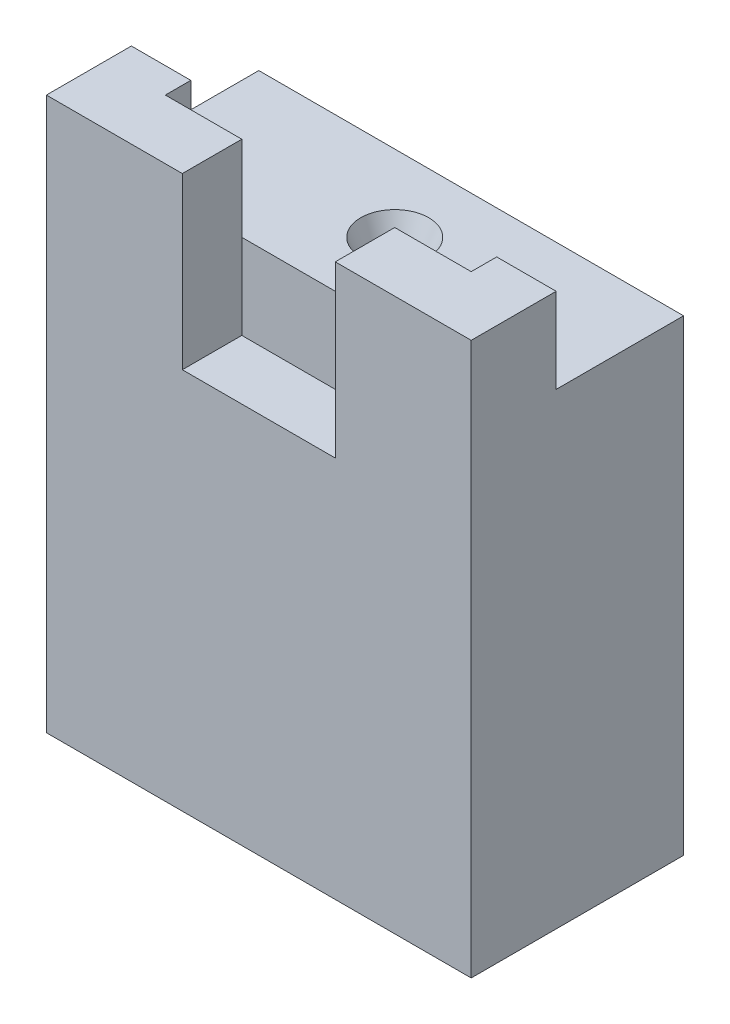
from build123d import *

# Parameters (mm, degrees)
SKETCH_1_W          = 50
SKETCH_1_H          = 25
EXTRUDE_1_DEPTH     = 55
SKETCH_3_W          = 18
SKETCH_3_H          = 7
CUT_EXTRUDE_2_DEPTH = 10
EXTRUDE_2_DEPTH     = 10


with BuildPart() as part:
    # Sketch 1 → Extrude 1 (new body)
    with BuildSketch(Plane(origin=(0, 0, 0), x_dir=(1, 0, 0), z_dir=(0, 1, 0))):
        Rectangle(SKETCH_1_W, SKETCH_1_H)
    extrude(amount=EXTRUDE_1_DEPTH)

    # Sketch 3 → Cut-Extrude 2 (cut)
    with BuildSketch(Plane(origin=(0, 55, 0), x_dir=(1, 0, 0), z_dir=(0, 1, 0))):
        with Locations((0, -9)):
            Rectangle(SKETCH_3_W, SKETCH_3_H)
    extrude(amount=-CUT_EXTRUDE_2_DEPTH, mode=Mode.SUBTRACT)

    # Sketch 5 → Cut-Revolve 1 (revolve, cut)
    with BuildSketch(Plane(origin=(0, 0, 0), x_dir=(0, 0, -1), z_dir=(1, 0, 0))):
        Polygon((3.5, 55), (-0.5, 55), (3.5, 45.559401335), align=None)
    revolve(axis=Axis((0, 4.092667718, -3.5), (0, 1, 0)), mode=Mode.SUBTRACT)

    # Sketch 4 → Extrude 2 (add)
    with BuildSketch(Plane(origin=(0, 55, 0), x_dir=(1, 0, 0), z_dir=(0, 1, 0))):
        Polygon((-9, -5.5), (-18, -5.5), (-18, -2.5), (-25, -2.5), (-25, -12.5), (-9, -12.5), align=None)
        Polygon((9, -12.5), (9, -5.5), (18, -5.5), (18, -2.5), (25, -2.5), (25, -12.5), align=None)
    extrude(amount=EXTRUDE_2_DEPTH)


solid = part.part
